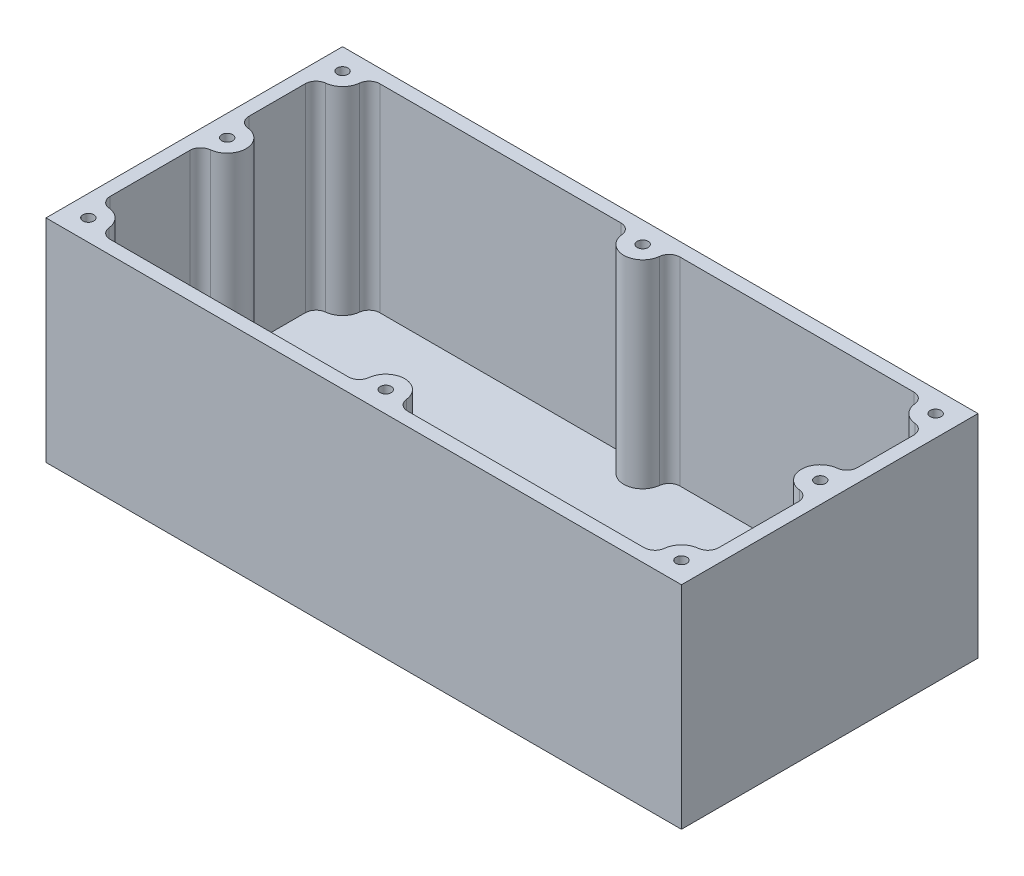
ISO-10303-21;
HEADER;
FILE_DESCRIPTION(('STEP AP214'),'2;1');
FILE_NAME('part.step','',(''),(''),'','','');
FILE_SCHEMA(('AUTOMOTIVE_DESIGN { 1 0 10303 214 1 1 1 1 }'));
ENDSEC;
DATA;
#1=APPLICATION_CONTEXT('core data for automotive mechanical design processes');
#2=APPLICATION_PROTOCOL_DEFINITION('international standard','automotive_design',2000,#1);
#3=PRODUCT_CONTEXT('',#1,'mechanical');
#4=PRODUCT('Part','Part','',(#3));
#5=PRODUCT_RELATED_PRODUCT_CATEGORY('part','',(#4));
#6=PRODUCT_DEFINITION_FORMATION('','',#4);
#7=PRODUCT_DEFINITION_CONTEXT('part definition',#1,'design');
#8=PRODUCT_DEFINITION('design','',#6,#7);
#9=PRODUCT_DEFINITION_SHAPE('','',#8);
#10=(LENGTH_UNIT() NAMED_UNIT(*) SI_UNIT(.MILLI.,.METRE.));
#11=(NAMED_UNIT(*) PLANE_ANGLE_UNIT() SI_UNIT($,.RADIAN.));
#12=(NAMED_UNIT(*) SI_UNIT($,.STERADIAN.) SOLID_ANGLE_UNIT());
#13=UNCERTAINTY_MEASURE_WITH_UNIT(LENGTH_MEASURE(1.E-05),#10,'distance_accuracy_value','');
#14=(GEOMETRIC_REPRESENTATION_CONTEXT(3) GLOBAL_UNCERTAINTY_ASSIGNED_CONTEXT((#13)) GLOBAL_UNIT_ASSIGNED_CONTEXT((#10,
#11,#12)) REPRESENTATION_CONTEXT('',''));
#15=CARTESIAN_POINT('',(0.,0.,0.));
#16=DIRECTION('',(0.,0.,1.));
#17=DIRECTION('',(1.,0.,0.));
#18=AXIS2_PLACEMENT_3D('',#15,#16,#17);
#19=CARTESIAN_POINT('',(0.,50.,0.));
#20=DIRECTION('',(0.,-1.,0.));
#21=DIRECTION('',(0.,0.,-1.));
#22=AXIS2_PLACEMENT_3D('',#19,#20,#21);
#23=PLANE('',#22);
#24=CARTESIAN_POINT('',(70.,50.,-30.));
#25=DIRECTION('',(0.,1.,0.));
#26=DIRECTION('',(0.,0.,1.));
#27=AXIS2_PLACEMENT_3D('',#24,#25,#26);
#28=CIRCLE('',#27,1.28904999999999);
#29=CARTESIAN_POINT('',(70.,50.,-28.71095));
#30=VERTEX_POINT('',#29);
#31=EDGE_CURVE('E655',#30,#30,#28,.T.);
#32=ORIENTED_EDGE('',*,*,#31,.F.);
#33=EDGE_LOOP('',(#32));
#34=FACE_BOUND('',#33,.T.);
#35=CARTESIAN_POINT('',(70.,50.,-2.76133775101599));
#36=DIRECTION('',(0.,1.,0.));
#37=DIRECTION('',(0.,0.,1.));
#38=AXIS2_PLACEMENT_3D('',#35,#36,#37);
#39=CIRCLE('',#38,1.28904999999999);
#40=CARTESIAN_POINT('',(70.,50.,-1.472287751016));
#41=VERTEX_POINT('',#40);
#42=EDGE_CURVE('E663',#41,#41,#39,.T.);
#43=ORIENTED_EDGE('',*,*,#42,.F.);
#44=EDGE_LOOP('',(#43));
#45=FACE_BOUND('',#44,.T.);
#46=CARTESIAN_POINT('',(70.,50.,30.));
#47=DIRECTION('',(0.,1.,0.));
#48=DIRECTION('',(0.,0.,1.));
#49=AXIS2_PLACEMENT_3D('',#46,#47,#48);
#50=CIRCLE('',#49,1.28904999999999);
#51=CARTESIAN_POINT('',(70.,50.,31.28905));
#52=VERTEX_POINT('',#51);
#53=EDGE_CURVE('E671',#52,#52,#50,.T.);
#54=ORIENTED_EDGE('',*,*,#53,.F.);
#55=EDGE_LOOP('',(#54));
#56=FACE_BOUND('',#55,.T.);
#57=CARTESIAN_POINT('',(0.846805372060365,50.,-30.));
#58=DIRECTION('',(0.,1.,0.));
#59=DIRECTION('',(0.,0.,1.));
#60=AXIS2_PLACEMENT_3D('',#57,#58,#59);
#61=CIRCLE('',#60,1.28904999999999);
#62=CARTESIAN_POINT('',(0.846805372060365,50.,-28.71095));
#63=VERTEX_POINT('',#62);
#64=EDGE_CURVE('E679',#63,#63,#61,.T.);
#65=ORIENTED_EDGE('',*,*,#64,.F.);
#66=EDGE_LOOP('',(#65));
#67=FACE_BOUND('',#66,.T.);
#68=CARTESIAN_POINT('',(-70.,50.,-30.));
#69=DIRECTION('',(0.,1.,0.));
#70=DIRECTION('',(0.,0.,1.));
#71=AXIS2_PLACEMENT_3D('',#68,#69,#70);
#72=CIRCLE('',#71,1.28904999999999);
#73=CARTESIAN_POINT('',(-70.,50.,-28.71095));
#74=VERTEX_POINT('',#73);
#75=EDGE_CURVE('E687',#74,#74,#72,.T.);
#76=ORIENTED_EDGE('',*,*,#75,.F.);
#77=EDGE_LOOP('',(#76));
#78=FACE_BOUND('',#77,.T.);
#79=CARTESIAN_POINT('',(-70.,50.,-2.76133775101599));
#80=DIRECTION('',(0.,1.,0.));
#81=DIRECTION('',(0.,0.,1.));
#82=AXIS2_PLACEMENT_3D('',#79,#80,#81);
#83=CIRCLE('',#82,1.28904999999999);
#84=CARTESIAN_POINT('',(-70.,50.,-1.472287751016));
#85=VERTEX_POINT('',#84);
#86=EDGE_CURVE('E695',#85,#85,#83,.T.);
#87=ORIENTED_EDGE('',*,*,#86,.F.);
#88=EDGE_LOOP('',(#87));
#89=FACE_BOUND('',#88,.T.);
#90=CARTESIAN_POINT('',(-70.,50.,30.));
#91=DIRECTION('',(0.,1.,0.));
#92=DIRECTION('',(0.,0.,1.));
#93=AXIS2_PLACEMENT_3D('',#90,#91,#92);
#94=CIRCLE('',#93,1.28904999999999);
#95=CARTESIAN_POINT('',(-70.,50.,31.28905));
#96=VERTEX_POINT('',#95);
#97=EDGE_CURVE('E703',#96,#96,#94,.T.);
#98=ORIENTED_EDGE('',*,*,#97,.F.);
#99=EDGE_LOOP('',(#98));
#100=FACE_BOUND('',#99,.T.);
#101=CARTESIAN_POINT('',(0.198089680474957,50.,30.));
#102=DIRECTION('',(0.,1.,0.));
#103=DIRECTION('',(0.,0.,1.));
#104=AXIS2_PLACEMENT_3D('',#101,#102,#103);
#105=CIRCLE('',#104,1.28904999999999);
#106=CARTESIAN_POINT('',(0.198089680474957,50.,31.28905));
#107=VERTEX_POINT('',#106);
#108=EDGE_CURVE('E710',#107,#107,#105,.T.);
#109=ORIENTED_EDGE('',*,*,#108,.F.);
#110=EDGE_LOOP('',(#109));
#111=FACE_BOUND('',#110,.T.);
#112=DIRECTION('',(0.,0.,-1.));
#113=VECTOR('',#112,1.);
#114=CARTESIAN_POINT('',(-75.,50.,35.));
#115=LINE('',#114,#113);
#116=CARTESIAN_POINT('',(-75.,50.,35.));
#117=VERTEX_POINT('',#116);
#118=CARTESIAN_POINT('',(-75.,50.,-35.));
#119=VERTEX_POINT('',#118);
#120=EDGE_CURVE('E293',#117,#119,#115,.T.);
#121=ORIENTED_EDGE('',*,*,#120,.F.);
#122=DIRECTION('',(1.,0.,0.));
#123=VECTOR('',#122,1.);
#124=CARTESIAN_POINT('',(-75.,50.,35.));
#125=LINE('',#124,#123);
#126=CARTESIAN_POINT('',(75.,50.,35.));
#127=VERTEX_POINT('',#126);
#128=EDGE_CURVE('E289',#117,#127,#125,.T.);
#129=ORIENTED_EDGE('',*,*,#128,.T.);
#130=DIRECTION('',(0.,0.,-1.));
#131=VECTOR('',#130,1.);
#132=CARTESIAN_POINT('',(75.,50.,35.));
#133=LINE('',#132,#131);
#134=CARTESIAN_POINT('',(75.,50.,-35.));
#135=VERTEX_POINT('',#134);
#136=EDGE_CURVE('E295',#127,#135,#133,.T.);
#137=ORIENTED_EDGE('',*,*,#136,.T.);
#138=DIRECTION('',(1.,0.,0.));
#139=VECTOR('',#138,1.);
#140=CARTESIAN_POINT('',(-75.,50.,-35.));
#141=LINE('',#140,#139);
#142=EDGE_CURVE('E280',#119,#135,#141,.T.);
#143=ORIENTED_EDGE('',*,*,#142,.F.);
#144=EDGE_LOOP('',(#121,#129,#137,#143));
#145=FACE_BOUND('',#144,.T.);
#146=DIRECTION('',(1.,0.,0.));
#147=VECTOR('',#146,1.);
#148=CARTESIAN_POINT('',(0.,50.,31.825));
#149=LINE('',#148,#147);
#150=CARTESIAN_POINT('',(-63.0325405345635,50.,31.825));
#151=VERTEX_POINT('',#150);
#152=CARTESIAN_POINT('',(-6.76936978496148,50.,31.825));
#153=VERTEX_POINT('',#152);
#154=EDGE_CURVE('E624',#151,#153,#149,.T.);
#155=ORIENTED_EDGE('',*,*,#154,.F.);
#156=CARTESIAN_POINT('',(-63.0325405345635,50.,29.285));
#157=DIRECTION('',(0.,-1.,0.));
#158=DIRECTION('',(0.,0.,-1.));
#159=AXIS2_PLACEMENT_3D('',#156,#157,#158);
#160=CIRCLE('',#159,2.54);
#161=CARTESIAN_POINT('',(-65.5592710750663,50.,29.5442928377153));
#162=VERTEX_POINT('',#161);
#163=EDGE_CURVE('E491',#151,#162,#160,.T.);
#164=ORIENTED_EDGE('',*,*,#163,.T.);
#165=CARTESIAN_POINT('',(-70.,50.,30.));
#166=DIRECTION('',(0.,-1.,0.));
#167=DIRECTION('',(0.,0.,-1.));
#168=AXIS2_PLACEMENT_3D('',#165,#166,#167);
#169=CIRCLE('',#168,4.46404999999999);
#170=CARTESIAN_POINT('',(-69.5442928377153,50.,25.5592710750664));
#171=VERTEX_POINT('',#170);
#172=EDGE_CURVE('E608',#162,#171,#169,.F.);
#173=ORIENTED_EDGE('',*,*,#172,.T.);
#174=CARTESIAN_POINT('',(-69.285,50.,23.0325405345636));
#175=DIRECTION('',(0.,-1.,0.));
#176=DIRECTION('',(0.,0.,-1.));
#177=AXIS2_PLACEMENT_3D('',#174,#175,#176);
#178=CIRCLE('',#177,2.54);
#179=CARTESIAN_POINT('',(-71.825,50.,23.0325405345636));
#180=VERTEX_POINT('',#179);
#181=EDGE_CURVE('E52',#171,#180,#178,.T.);
#182=ORIENTED_EDGE('',*,*,#181,.T.);
#183=DIRECTION('',(0.,0.,-1.));
#184=VECTOR('',#183,1.);
#185=CARTESIAN_POINT('',(-71.825,50.,0.));
#186=LINE('',#185,#184);
#187=CARTESIAN_POINT('',(-71.825,50.,4.20612171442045));
#188=VERTEX_POINT('',#187);
#189=EDGE_CURVE('E536',#180,#188,#186,.T.);
#190=ORIENTED_EDGE('',*,*,#189,.T.);
#191=CARTESIAN_POINT('',(-69.285,50.,4.20612171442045));
#192=DIRECTION('',(0.,-1.,0.));
#193=DIRECTION('',(0.,0.,-1.));
#194=AXIS2_PLACEMENT_3D('',#191,#192,#193);
#195=CIRCLE('',#194,2.54);
#196=CARTESIAN_POINT('',(-69.5442928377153,50.,1.67939117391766));
#197=VERTEX_POINT('',#196);
#198=EDGE_CURVE('E59',#188,#197,#195,.T.);
#199=ORIENTED_EDGE('',*,*,#198,.T.);
#200=CARTESIAN_POINT('',(-70.,50.,-2.76133775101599));
#201=DIRECTION('',(0.,-1.,0.));
#202=DIRECTION('',(0.,0.,-1.));
#203=AXIS2_PLACEMENT_3D('',#200,#201,#202);
#204=CIRCLE('',#203,4.46404999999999);
#205=CARTESIAN_POINT('',(-69.5442928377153,50.,-7.20206667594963));
#206=VERTEX_POINT('',#205);
#207=EDGE_CURVE('E535',#197,#206,#204,.F.);
#208=ORIENTED_EDGE('',*,*,#207,.T.);
#209=CARTESIAN_POINT('',(-69.285,50.,-9.72879721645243));
#210=DIRECTION('',(0.,-1.,0.));
#211=DIRECTION('',(0.,0.,-1.));
#212=AXIS2_PLACEMENT_3D('',#209,#210,#211);
#213=CIRCLE('',#212,2.54);
#214=CARTESIAN_POINT('',(-71.825,50.,-9.72879721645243));
#215=VERTEX_POINT('',#214);
#216=EDGE_CURVE('E527',#206,#215,#213,.T.);
#217=ORIENTED_EDGE('',*,*,#216,.T.);
#218=CARTESIAN_POINT('',(-71.825,50.,-23.0325405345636));
#219=VERTEX_POINT('',#218);
#220=EDGE_CURVE('E619',#215,#219,#186,.T.);
#221=ORIENTED_EDGE('',*,*,#220,.T.);
#222=CARTESIAN_POINT('',(-69.285,50.,-23.0325405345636));
#223=DIRECTION('',(0.,-1.,0.));
#224=DIRECTION('',(0.,0.,-1.));
#225=AXIS2_PLACEMENT_3D('',#222,#223,#224);
#226=CIRCLE('',#225,2.54);
#227=CARTESIAN_POINT('',(-69.5442928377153,50.,-25.5592710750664));
#228=VERTEX_POINT('',#227);
#229=EDGE_CURVE('E524',#219,#228,#226,.T.);
#230=ORIENTED_EDGE('',*,*,#229,.T.);
#231=CARTESIAN_POINT('',(-70.,50.,-30.));
#232=DIRECTION('',(0.,-1.,0.));
#233=DIRECTION('',(0.,0.,-1.));
#234=AXIS2_PLACEMENT_3D('',#231,#232,#233);
#235=CIRCLE('',#234,4.46404999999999);
#236=CARTESIAN_POINT('',(-65.5592710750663,50.,-29.5442928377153));
#237=VERTEX_POINT('',#236);
#238=EDGE_CURVE('E602',#228,#237,#235,.F.);
#239=ORIENTED_EDGE('',*,*,#238,.T.);
#240=CARTESIAN_POINT('',(-63.0325405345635,50.,-29.285));
#241=DIRECTION('',(0.,-1.,0.));
#242=DIRECTION('',(0.,0.,-1.));
#243=AXIS2_PLACEMENT_3D('',#240,#241,#242);
#244=CIRCLE('',#243,2.54);
#245=CARTESIAN_POINT('',(-63.0325405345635,50.,-31.825));
#246=VERTEX_POINT('',#245);
#247=EDGE_CURVE('E521',#237,#246,#244,.T.);
#248=ORIENTED_EDGE('',*,*,#247,.T.);
#249=DIRECTION('',(1.,0.,0.));
#250=VECTOR('',#249,1.);
#251=CARTESIAN_POINT('',(0.,50.,-31.825));
#252=LINE('',#251,#250);
#253=CARTESIAN_POINT('',(-6.12065409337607,50.,-31.825));
#254=VERTEX_POINT('',#253);
#255=EDGE_CURVE('E631',#246,#254,#252,.T.);
#256=ORIENTED_EDGE('',*,*,#255,.T.);
#257=CARTESIAN_POINT('',(-6.12065409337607,50.,-29.285));
#258=DIRECTION('',(0.,-1.,0.));
#259=DIRECTION('',(0.,0.,-1.));
#260=AXIS2_PLACEMENT_3D('',#257,#258,#259);
#261=CIRCLE('',#260,2.54);
#262=CARTESIAN_POINT('',(-3.59392355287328,50.,-29.5442928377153));
#263=VERTEX_POINT('',#262);
#264=EDGE_CURVE('E518',#254,#263,#261,.T.);
#265=ORIENTED_EDGE('',*,*,#264,.T.);
#266=CARTESIAN_POINT('',(0.846805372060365,50.,-30.));
#267=DIRECTION('',(0.,-1.,0.));
#268=DIRECTION('',(0.,0.,-1.));
#269=AXIS2_PLACEMENT_3D('',#266,#267,#268);
#270=CIRCLE('',#269,4.46404999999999);
#271=CARTESIAN_POINT('',(5.28753429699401,50.,-29.5442928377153));
#272=VERTEX_POINT('',#271);
#273=EDGE_CURVE('E597',#263,#272,#270,.F.);
#274=ORIENTED_EDGE('',*,*,#273,.T.);
#275=CARTESIAN_POINT('',(7.8142648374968,50.,-29.285));
#276=DIRECTION('',(0.,-1.,0.));
#277=DIRECTION('',(0.,0.,-1.));
#278=AXIS2_PLACEMENT_3D('',#275,#276,#277);
#279=CIRCLE('',#278,2.54);
#280=CARTESIAN_POINT('',(7.8142648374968,50.,-31.825));
#281=VERTEX_POINT('',#280);
#282=EDGE_CURVE('E515',#272,#281,#279,.T.);
#283=ORIENTED_EDGE('',*,*,#282,.T.);
#284=CARTESIAN_POINT('',(63.0325405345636,50.,-31.825));
#285=VERTEX_POINT('',#284);
#286=EDGE_CURVE('E630',#281,#285,#252,.T.);
#287=ORIENTED_EDGE('',*,*,#286,.T.);
#288=CARTESIAN_POINT('',(63.0325405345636,50.,-29.285));
#289=DIRECTION('',(0.,-1.,0.));
#290=DIRECTION('',(0.,0.,-1.));
#291=AXIS2_PLACEMENT_3D('',#288,#289,#290);
#292=CIRCLE('',#291,2.54);
#293=CARTESIAN_POINT('',(65.5592710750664,50.,-29.5442928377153));
#294=VERTEX_POINT('',#293);
#295=EDGE_CURVE('E512',#285,#294,#292,.T.);
#296=ORIENTED_EDGE('',*,*,#295,.T.);
#297=CARTESIAN_POINT('',(70.,50.,-30.));
#298=DIRECTION('',(0.,-1.,0.));
#299=DIRECTION('',(0.,0.,-1.));
#300=AXIS2_PLACEMENT_3D('',#297,#298,#299);
#301=CIRCLE('',#300,4.46404999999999);
#302=CARTESIAN_POINT('',(69.5442928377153,50.,-25.5592710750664));
#303=VERTEX_POINT('',#302);
#304=EDGE_CURVE('E587',#294,#303,#301,.F.);
#305=ORIENTED_EDGE('',*,*,#304,.T.);
#306=CARTESIAN_POINT('',(69.285,50.,-23.0325405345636));
#307=DIRECTION('',(0.,-1.,0.));
#308=DIRECTION('',(0.,0.,-1.));
#309=AXIS2_PLACEMENT_3D('',#306,#307,#308);
#310=CIRCLE('',#309,2.54);
#311=CARTESIAN_POINT('',(71.825,50.,-23.0325405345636));
#312=VERTEX_POINT('',#311);
#313=EDGE_CURVE('E509',#303,#312,#310,.T.);
#314=ORIENTED_EDGE('',*,*,#313,.T.);
#315=DIRECTION('',(0.,0.,-1.));
#316=VECTOR('',#315,1.);
#317=CARTESIAN_POINT('',(71.825,50.,0.));
#318=LINE('',#317,#316);
#319=CARTESIAN_POINT('',(71.825,50.,-9.72879721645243));
#320=VERTEX_POINT('',#319);
#321=EDGE_CURVE('E626',#320,#312,#318,.T.);
#322=ORIENTED_EDGE('',*,*,#321,.F.);
#323=CARTESIAN_POINT('',(69.285,50.,-9.72879721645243));
#324=DIRECTION('',(0.,-1.,0.));
#325=DIRECTION('',(0.,0.,-1.));
#326=AXIS2_PLACEMENT_3D('',#323,#324,#325);
#327=CIRCLE('',#326,2.54);
#328=CARTESIAN_POINT('',(69.5442928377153,50.,-7.20206667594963));
#329=VERTEX_POINT('',#328);
#330=EDGE_CURVE('E506',#320,#329,#327,.T.);
#331=ORIENTED_EDGE('',*,*,#330,.T.);
#332=CARTESIAN_POINT('',(70.,50.,-2.76133775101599));
#333=DIRECTION('',(0.,-1.,0.));
#334=DIRECTION('',(0.,0.,-1.));
#335=AXIS2_PLACEMENT_3D('',#332,#333,#334);
#336=CIRCLE('',#335,4.46404999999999);
#337=CARTESIAN_POINT('',(69.5442928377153,50.,1.67939117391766));
#338=VERTEX_POINT('',#337);
#339=EDGE_CURVE('E586',#329,#338,#336,.F.);
#340=ORIENTED_EDGE('',*,*,#339,.T.);
#341=CARTESIAN_POINT('',(69.285,50.,4.20612171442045));
#342=DIRECTION('',(0.,-1.,0.));
#343=DIRECTION('',(0.,0.,-1.));
#344=AXIS2_PLACEMENT_3D('',#341,#342,#343);
#345=CIRCLE('',#344,2.54);
#346=CARTESIAN_POINT('',(71.825,50.,4.20612171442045));
#347=VERTEX_POINT('',#346);
#348=EDGE_CURVE('E503',#338,#347,#345,.T.);
#349=ORIENTED_EDGE('',*,*,#348,.T.);
#350=CARTESIAN_POINT('',(71.825,50.,23.0325405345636));
#351=VERTEX_POINT('',#350);
#352=EDGE_CURVE('E625',#351,#347,#318,.T.);
#353=ORIENTED_EDGE('',*,*,#352,.F.);
#354=CARTESIAN_POINT('',(69.285,50.,23.0325405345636));
#355=DIRECTION('',(0.,-1.,0.));
#356=DIRECTION('',(0.,0.,-1.));
#357=AXIS2_PLACEMENT_3D('',#354,#355,#356);
#358=CIRCLE('',#357,2.54);
#359=CARTESIAN_POINT('',(69.5442928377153,50.,25.5592710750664));
#360=VERTEX_POINT('',#359);
#361=EDGE_CURVE('E11',#351,#360,#358,.T.);
#362=ORIENTED_EDGE('',*,*,#361,.T.);
#363=CARTESIAN_POINT('',(70.,50.,30.));
#364=DIRECTION('',(0.,-1.,0.));
#365=DIRECTION('',(0.,0.,-1.));
#366=AXIS2_PLACEMENT_3D('',#363,#364,#365);
#367=CIRCLE('',#366,4.46404999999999);
#368=CARTESIAN_POINT('',(65.5592710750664,50.,29.5442928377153));
#369=VERTEX_POINT('',#368);
#370=EDGE_CURVE('E592',#360,#369,#367,.F.);
#371=ORIENTED_EDGE('',*,*,#370,.T.);
#372=CARTESIAN_POINT('',(63.0325405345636,50.,29.285));
#373=DIRECTION('',(0.,-1.,0.));
#374=DIRECTION('',(0.,0.,-1.));
#375=AXIS2_PLACEMENT_3D('',#372,#373,#374);
#376=CIRCLE('',#375,2.54);
#377=CARTESIAN_POINT('',(63.0325405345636,50.,31.825));
#378=VERTEX_POINT('',#377);
#379=EDGE_CURVE('E500',#369,#378,#376,.T.);
#380=ORIENTED_EDGE('',*,*,#379,.T.);
#381=CARTESIAN_POINT('',(7.1655491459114,50.,31.825));
#382=VERTEX_POINT('',#381);
#383=EDGE_CURVE('E620',#382,#378,#149,.T.);
#384=ORIENTED_EDGE('',*,*,#383,.F.);
#385=CARTESIAN_POINT('',(7.1655491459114,50.,29.285));
#386=DIRECTION('',(0.,-1.,0.));
#387=DIRECTION('',(0.,0.,-1.));
#388=AXIS2_PLACEMENT_3D('',#385,#386,#387);
#389=CIRCLE('',#388,2.54);
#390=CARTESIAN_POINT('',(4.6388186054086,50.,29.5442928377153));
#391=VERTEX_POINT('',#390);
#392=EDGE_CURVE('E497',#382,#391,#389,.T.);
#393=ORIENTED_EDGE('',*,*,#392,.T.);
#394=CARTESIAN_POINT('',(0.198089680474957,50.,30.));
#395=DIRECTION('',(0.,-1.,0.));
#396=DIRECTION('',(0.,0.,-1.));
#397=AXIS2_PLACEMENT_3D('',#394,#395,#396);
#398=CIRCLE('',#397,4.46404999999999);
#399=CARTESIAN_POINT('',(-4.24263924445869,50.,29.5442928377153));
#400=VERTEX_POINT('',#399);
#401=EDGE_CURVE('E613',#391,#400,#398,.F.);
#402=ORIENTED_EDGE('',*,*,#401,.T.);
#403=CARTESIAN_POINT('',(-6.76936978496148,50.,29.285));
#404=DIRECTION('',(0.,-1.,0.));
#405=DIRECTION('',(0.,0.,-1.));
#406=AXIS2_PLACEMENT_3D('',#403,#404,#405);
#407=CIRCLE('',#406,2.54);
#408=EDGE_CURVE('E494',#400,#153,#407,.T.);
#409=ORIENTED_EDGE('',*,*,#408,.T.);
#410=EDGE_LOOP('',(#155,#164,#173,#182,#190,#199,#208,#217,#221,#230,#239,#248,#256,#265,#274,
#283,#287,#296,#305,#314,#322,#331,#340,#349,#353,#362,#371,#380,#384,#393,#402,#409));
#411=FACE_BOUND('',#410,.T.);
#412=ADVANCED_FACE('F43',(#34,#45,#56,#67,#78,#89,#100,#111,#145,#411),#23,.F.);
#413=CARTESIAN_POINT('',(-75.,50.,35.));
#414=DIRECTION('',(-1.,0.,0.));
#415=DIRECTION('',(0.,0.,1.));
#416=AXIS2_PLACEMENT_3D('',#413,#414,#415);
#417=PLANE('',#416);
#418=DIRECTION('',(0.,0.,-1.));
#419=VECTOR('',#418,1.);
#420=CARTESIAN_POINT('',(-75.,0.,35.));
#421=LINE('',#420,#419);
#422=CARTESIAN_POINT('',(-75.,0.,35.));
#423=VERTEX_POINT('',#422);
#424=CARTESIAN_POINT('',(-75.,0.,-35.));
#425=VERTEX_POINT('',#424);
#426=EDGE_CURVE('E316',#423,#425,#421,.T.);
#427=ORIENTED_EDGE('',*,*,#426,.F.);
#428=DIRECTION('',(0.,-1.,0.));
#429=VECTOR('',#428,1.);
#430=CARTESIAN_POINT('',(-75.,50.,35.));
#431=LINE('',#430,#429);
#432=EDGE_CURVE('E300',#117,#423,#431,.T.);
#433=ORIENTED_EDGE('',*,*,#432,.F.);
#434=ORIENTED_EDGE('',*,*,#120,.T.);
#435=DIRECTION('',(0.,-1.,0.));
#436=VECTOR('',#435,1.);
#437=CARTESIAN_POINT('',(-75.,50.,-35.));
#438=LINE('',#437,#436);
#439=EDGE_CURVE('E277',#119,#425,#438,.T.);
#440=ORIENTED_EDGE('',*,*,#439,.T.);
#441=EDGE_LOOP('',(#427,#433,#434,#440));
#442=FACE_BOUND('',#441,.T.);
#443=ADVANCED_FACE('F299',(#442),#417,.T.);
#444=CARTESIAN_POINT('',(-75.,50.,35.));
#445=DIRECTION('',(0.,0.,-1.));
#446=DIRECTION('',(-1.,0.,0.));
#447=AXIS2_PLACEMENT_3D('',#444,#445,#446);
#448=PLANE('',#447);
#449=DIRECTION('',(1.,0.,0.));
#450=VECTOR('',#449,1.);
#451=CARTESIAN_POINT('',(-75.,0.,35.));
#452=LINE('',#451,#450);
#453=CARTESIAN_POINT('',(75.,0.,35.));
#454=VERTEX_POINT('',#453);
#455=EDGE_CURVE('E303',#423,#454,#452,.T.);
#456=ORIENTED_EDGE('',*,*,#455,.T.);
#457=DIRECTION('',(0.,-1.,0.));
#458=VECTOR('',#457,1.);
#459=CARTESIAN_POINT('',(75.,50.,35.));
#460=LINE('',#459,#458);
#461=EDGE_CURVE('E327',#127,#454,#460,.T.);
#462=ORIENTED_EDGE('',*,*,#461,.F.);
#463=ORIENTED_EDGE('',*,*,#128,.F.);
#464=ORIENTED_EDGE('',*,*,#432,.T.);
#465=EDGE_LOOP('',(#456,#462,#463,#464));
#466=FACE_BOUND('',#465,.T.);
#467=ADVANCED_FACE('F741',(#466),#448,.F.);
#468=CARTESIAN_POINT('',(75.,50.,35.));
#469=DIRECTION('',(-1.,0.,0.));
#470=DIRECTION('',(0.,0.,1.));
#471=AXIS2_PLACEMENT_3D('',#468,#469,#470);
#472=PLANE('',#471);
#473=DIRECTION('',(0.,0.,-1.));
#474=VECTOR('',#473,1.);
#475=CARTESIAN_POINT('',(75.,0.,35.));
#476=LINE('',#475,#474);
#477=CARTESIAN_POINT('',(75.,0.,-35.));
#478=VERTEX_POINT('',#477);
#479=EDGE_CURVE('E306',#454,#478,#476,.T.);
#480=ORIENTED_EDGE('',*,*,#479,.T.);
#481=DIRECTION('',(0.,-1.,0.));
#482=VECTOR('',#481,1.);
#483=CARTESIAN_POINT('',(75.,50.,-35.));
#484=LINE('',#483,#482);
#485=EDGE_CURVE('E288',#135,#478,#484,.T.);
#486=ORIENTED_EDGE('',*,*,#485,.F.);
#487=ORIENTED_EDGE('',*,*,#136,.F.);
#488=ORIENTED_EDGE('',*,*,#461,.T.);
#489=EDGE_LOOP('',(#480,#486,#487,#488));
#490=FACE_BOUND('',#489,.T.);
#491=ADVANCED_FACE('F748',(#490),#472,.F.);
#492=CARTESIAN_POINT('',(-75.,50.,-35.));
#493=DIRECTION('',(0.,0.,-1.));
#494=DIRECTION('',(-1.,0.,0.));
#495=AXIS2_PLACEMENT_3D('',#492,#493,#494);
#496=PLANE('',#495);
#497=DIRECTION('',(1.,0.,0.));
#498=VECTOR('',#497,1.);
#499=CARTESIAN_POINT('',(-75.,0.,-35.));
#500=LINE('',#499,#498);
#501=EDGE_CURVE('E282',#425,#478,#500,.T.);
#502=ORIENTED_EDGE('',*,*,#501,.F.);
#503=ORIENTED_EDGE('',*,*,#439,.F.);
#504=ORIENTED_EDGE('',*,*,#142,.T.);
#505=ORIENTED_EDGE('',*,*,#485,.T.);
#506=EDGE_LOOP('',(#502,#503,#504,#505));
#507=FACE_BOUND('',#506,.T.);
#508=ADVANCED_FACE('F279',(#507),#496,.T.);
#509=CARTESIAN_POINT('',(0.,0.,0.));
#510=DIRECTION('',(0.,-1.,0.));
#511=DIRECTION('',(0.,0.,-1.));
#512=AXIS2_PLACEMENT_3D('',#509,#510,#511);
#513=PLANE('',#512);
#514=CARTESIAN_POINT('',(70.,0.,-30.));
#515=DIRECTION('',(0.,1.,0.));
#516=DIRECTION('',(0.,0.,1.));
#517=AXIS2_PLACEMENT_3D('',#514,#515,#516);
#518=CIRCLE('',#517,1.28904999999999);
#519=CARTESIAN_POINT('',(70.,0.,-28.71095));
#520=VERTEX_POINT('',#519);
#521=EDGE_CURVE('E659',#520,#520,#518,.T.);
#522=ORIENTED_EDGE('',*,*,#521,.T.);
#523=EDGE_LOOP('',(#522));
#524=FACE_BOUND('',#523,.T.);
#525=CARTESIAN_POINT('',(70.,0.,-2.76133775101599));
#526=DIRECTION('',(0.,1.,0.));
#527=DIRECTION('',(0.,0.,1.));
#528=AXIS2_PLACEMENT_3D('',#525,#526,#527);
#529=CIRCLE('',#528,1.28904999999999);
#530=CARTESIAN_POINT('',(70.,0.,-1.472287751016));
#531=VERTEX_POINT('',#530);
#532=EDGE_CURVE('E667',#531,#531,#529,.T.);
#533=ORIENTED_EDGE('',*,*,#532,.T.);
#534=EDGE_LOOP('',(#533));
#535=FACE_BOUND('',#534,.T.);
#536=CARTESIAN_POINT('',(70.,0.,30.));
#537=DIRECTION('',(0.,1.,0.));
#538=DIRECTION('',(0.,0.,1.));
#539=AXIS2_PLACEMENT_3D('',#536,#537,#538);
#540=CIRCLE('',#539,1.28904999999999);
#541=CARTESIAN_POINT('',(70.,0.,31.28905));
#542=VERTEX_POINT('',#541);
#543=EDGE_CURVE('E675',#542,#542,#540,.T.);
#544=ORIENTED_EDGE('',*,*,#543,.T.);
#545=EDGE_LOOP('',(#544));
#546=FACE_BOUND('',#545,.T.);
#547=CARTESIAN_POINT('',(0.846805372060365,0.,-30.));
#548=DIRECTION('',(0.,1.,0.));
#549=DIRECTION('',(0.,0.,1.));
#550=AXIS2_PLACEMENT_3D('',#547,#548,#549);
#551=CIRCLE('',#550,1.28904999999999);
#552=CARTESIAN_POINT('',(0.846805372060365,0.,-28.71095));
#553=VERTEX_POINT('',#552);
#554=EDGE_CURVE('E683',#553,#553,#551,.T.);
#555=ORIENTED_EDGE('',*,*,#554,.T.);
#556=EDGE_LOOP('',(#555));
#557=FACE_BOUND('',#556,.T.);
#558=CARTESIAN_POINT('',(-70.,0.,-30.));
#559=DIRECTION('',(0.,1.,0.));
#560=DIRECTION('',(0.,0.,1.));
#561=AXIS2_PLACEMENT_3D('',#558,#559,#560);
#562=CIRCLE('',#561,1.28904999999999);
#563=CARTESIAN_POINT('',(-70.,0.,-28.71095));
#564=VERTEX_POINT('',#563);
#565=EDGE_CURVE('E691',#564,#564,#562,.T.);
#566=ORIENTED_EDGE('',*,*,#565,.T.);
#567=EDGE_LOOP('',(#566));
#568=FACE_BOUND('',#567,.T.);
#569=CARTESIAN_POINT('',(-70.,0.,-2.76133775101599));
#570=DIRECTION('',(0.,1.,0.));
#571=DIRECTION('',(0.,0.,1.));
#572=AXIS2_PLACEMENT_3D('',#569,#570,#571);
#573=CIRCLE('',#572,1.28904999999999);
#574=CARTESIAN_POINT('',(-70.,0.,-1.472287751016));
#575=VERTEX_POINT('',#574);
#576=EDGE_CURVE('E699',#575,#575,#573,.T.);
#577=ORIENTED_EDGE('',*,*,#576,.T.);
#578=EDGE_LOOP('',(#577));
#579=FACE_BOUND('',#578,.T.);
#580=CARTESIAN_POINT('',(-70.,0.,30.));
#581=DIRECTION('',(0.,1.,0.));
#582=DIRECTION('',(0.,0.,1.));
#583=AXIS2_PLACEMENT_3D('',#580,#581,#582);
#584=CIRCLE('',#583,1.28904999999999);
#585=CARTESIAN_POINT('',(-70.,0.,31.28905));
#586=VERTEX_POINT('',#585);
#587=EDGE_CURVE('E707',#586,#586,#584,.T.);
#588=ORIENTED_EDGE('',*,*,#587,.T.);
#589=EDGE_LOOP('',(#588));
#590=FACE_BOUND('',#589,.T.);
#591=CARTESIAN_POINT('',(0.198089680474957,0.,30.));
#592=DIRECTION('',(0.,1.,0.));
#593=DIRECTION('',(0.,0.,1.));
#594=AXIS2_PLACEMENT_3D('',#591,#592,#593);
#595=CIRCLE('',#594,1.28904999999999);
#596=CARTESIAN_POINT('',(0.198089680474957,0.,31.28905));
#597=VERTEX_POINT('',#596);
#598=EDGE_CURVE('E309',#597,#597,#595,.T.);
#599=ORIENTED_EDGE('',*,*,#598,.T.);
#600=EDGE_LOOP('',(#599));
#601=FACE_BOUND('',#600,.T.);
#602=ORIENTED_EDGE('',*,*,#426,.T.);
#603=ORIENTED_EDGE('',*,*,#501,.T.);
#604=ORIENTED_EDGE('',*,*,#479,.F.);
#605=ORIENTED_EDGE('',*,*,#455,.F.);
#606=EDGE_LOOP('',(#602,#603,#604,#605));
#607=FACE_BOUND('',#606,.T.);
#608=ADVANCED_FACE('F719',(#524,#535,#546,#557,#568,#579,#590,#601,#607),#513,.T.);
#609=CARTESIAN_POINT('',(0.198089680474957,50.,30.));
#610=DIRECTION('',(0.,1.,0.));
#611=DIRECTION('',(0.,0.,1.));
#612=AXIS2_PLACEMENT_3D('',#609,#610,#611);
#613=CYLINDRICAL_SURFACE('',#612,1.28904999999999);
#614=ORIENTED_EDGE('',*,*,#598,.F.);
#615=EDGE_LOOP('',(#614));
#616=FACE_BOUND('',#615,.T.);
#617=ORIENTED_EDGE('',*,*,#108,.T.);
#618=EDGE_LOOP('',(#617));
#619=FACE_BOUND('',#618,.T.);
#620=ADVANCED_FACE('F722',(#616,#619),#613,.F.);
#621=CARTESIAN_POINT('',(-70.,50.,30.));
#622=DIRECTION('',(0.,1.,0.));
#623=DIRECTION('',(0.,0.,1.));
#624=AXIS2_PLACEMENT_3D('',#621,#622,#623);
#625=CYLINDRICAL_SURFACE('',#624,1.28904999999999);
#626=ORIENTED_EDGE('',*,*,#587,.F.);
#627=EDGE_LOOP('',(#626));
#628=FACE_BOUND('',#627,.T.);
#629=ORIENTED_EDGE('',*,*,#97,.T.);
#630=EDGE_LOOP('',(#629));
#631=FACE_BOUND('',#630,.T.);
#632=ADVANCED_FACE('F724',(#628,#631),#625,.F.);
#633=CARTESIAN_POINT('',(-70.,50.,-2.76133775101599));
#634=DIRECTION('',(0.,1.,0.));
#635=DIRECTION('',(0.,0.,1.));
#636=AXIS2_PLACEMENT_3D('',#633,#634,#635);
#637=CYLINDRICAL_SURFACE('',#636,1.28904999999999);
#638=ORIENTED_EDGE('',*,*,#576,.F.);
#639=EDGE_LOOP('',(#638));
#640=FACE_BOUND('',#639,.T.);
#641=ORIENTED_EDGE('',*,*,#86,.T.);
#642=EDGE_LOOP('',(#641));
#643=FACE_BOUND('',#642,.T.);
#644=ADVANCED_FACE('F730',(#640,#643),#637,.F.);
#645=CARTESIAN_POINT('',(-70.,50.,-30.));
#646=DIRECTION('',(0.,1.,0.));
#647=DIRECTION('',(0.,0.,1.));
#648=AXIS2_PLACEMENT_3D('',#645,#646,#647);
#649=CYLINDRICAL_SURFACE('',#648,1.28904999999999);
#650=ORIENTED_EDGE('',*,*,#565,.F.);
#651=EDGE_LOOP('',(#650));
#652=FACE_BOUND('',#651,.T.);
#653=ORIENTED_EDGE('',*,*,#75,.T.);
#654=EDGE_LOOP('',(#653));
#655=FACE_BOUND('',#654,.T.);
#656=ADVANCED_FACE('F948',(#652,#655),#649,.F.);
#657=CARTESIAN_POINT('',(0.846805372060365,50.,-30.));
#658=DIRECTION('',(0.,1.,0.));
#659=DIRECTION('',(0.,0.,1.));
#660=AXIS2_PLACEMENT_3D('',#657,#658,#659);
#661=CYLINDRICAL_SURFACE('',#660,1.28904999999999);
#662=ORIENTED_EDGE('',*,*,#554,.F.);
#663=EDGE_LOOP('',(#662));
#664=FACE_BOUND('',#663,.T.);
#665=ORIENTED_EDGE('',*,*,#64,.T.);
#666=EDGE_LOOP('',(#665));
#667=FACE_BOUND('',#666,.T.);
#668=ADVANCED_FACE('F944',(#664,#667),#661,.F.);
#669=CARTESIAN_POINT('',(70.,50.,30.));
#670=DIRECTION('',(0.,1.,0.));
#671=DIRECTION('',(0.,0.,1.));
#672=AXIS2_PLACEMENT_3D('',#669,#670,#671);
#673=CYLINDRICAL_SURFACE('',#672,1.28904999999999);
#674=ORIENTED_EDGE('',*,*,#543,.F.);
#675=EDGE_LOOP('',(#674));
#676=FACE_BOUND('',#675,.T.);
#677=ORIENTED_EDGE('',*,*,#53,.T.);
#678=EDGE_LOOP('',(#677));
#679=FACE_BOUND('',#678,.T.);
#680=ADVANCED_FACE('F940',(#676,#679),#673,.F.);
#681=CARTESIAN_POINT('',(70.,50.,-2.76133775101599));
#682=DIRECTION('',(0.,1.,0.));
#683=DIRECTION('',(0.,0.,1.));
#684=AXIS2_PLACEMENT_3D('',#681,#682,#683);
#685=CYLINDRICAL_SURFACE('',#684,1.28904999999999);
#686=ORIENTED_EDGE('',*,*,#532,.F.);
#687=EDGE_LOOP('',(#686));
#688=FACE_BOUND('',#687,.T.);
#689=ORIENTED_EDGE('',*,*,#42,.T.);
#690=EDGE_LOOP('',(#689));
#691=FACE_BOUND('',#690,.T.);
#692=ADVANCED_FACE('F936',(#688,#691),#685,.F.);
#693=CARTESIAN_POINT('',(70.,50.,-30.));
#694=DIRECTION('',(0.,1.,0.));
#695=DIRECTION('',(0.,0.,1.));
#696=AXIS2_PLACEMENT_3D('',#693,#694,#695);
#697=CYLINDRICAL_SURFACE('',#696,1.28904999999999);
#698=ORIENTED_EDGE('',*,*,#521,.F.);
#699=EDGE_LOOP('',(#698));
#700=FACE_BOUND('',#699,.T.);
#701=ORIENTED_EDGE('',*,*,#31,.T.);
#702=EDGE_LOOP('',(#701));
#703=FACE_BOUND('',#702,.T.);
#704=ADVANCED_FACE('F933',(#700,#703),#697,.F.);
#705=CARTESIAN_POINT('',(71.825,50.,35.));
#706=DIRECTION('',(-1.,0.,0.));
#707=DIRECTION('',(0.,0.,1.));
#708=AXIS2_PLACEMENT_3D('',#705,#706,#707);
#709=PLANE('',#708);
#710=ORIENTED_EDGE('',*,*,#352,.T.);
#711=DIRECTION('',(0.,-1.,0.));
#712=VECTOR('',#711,1.);
#713=CARTESIAN_POINT('',(71.825,3.175,4.20612171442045));
#714=LINE('',#713,#712);
#715=CARTESIAN_POINT('',(71.825,3.175,4.20612171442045));
#716=VERTEX_POINT('',#715);
#717=EDGE_CURVE('E419',#347,#716,#714,.T.);
#718=ORIENTED_EDGE('',*,*,#717,.T.);
#719=DIRECTION('',(0.,0.,-1.));
#720=VECTOR('',#719,1.);
#721=CARTESIAN_POINT('',(71.825,3.175,0.));
#722=LINE('',#721,#720);
#723=CARTESIAN_POINT('',(71.825,3.175,23.0325405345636));
#724=VERTEX_POINT('',#723);
#725=EDGE_CURVE('E578',#724,#716,#722,.T.);
#726=ORIENTED_EDGE('',*,*,#725,.F.);
#727=DIRECTION('',(0.,-1.,0.));
#728=VECTOR('',#727,1.);
#729=CARTESIAN_POINT('',(71.825,50.,23.0325405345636));
#730=LINE('',#729,#728);
#731=EDGE_CURVE('E416',#724,#351,#730,.F.);
#732=ORIENTED_EDGE('',*,*,#731,.T.);
#733=EDGE_LOOP('',(#710,#718,#726,#732));
#734=FACE_BOUND('',#733,.T.);
#735=ADVANCED_FACE('F853',(#734),#709,.T.);
#736=CARTESIAN_POINT('',(-75.,50.,-31.825));
#737=DIRECTION('',(0.,0.,-1.));
#738=DIRECTION('',(-1.,0.,0.));
#739=AXIS2_PLACEMENT_3D('',#736,#737,#738);
#740=PLANE('',#739);
#741=DIRECTION('',(1.,0.,0.));
#742=VECTOR('',#741,1.);
#743=CARTESIAN_POINT('',(0.,3.175,-31.825));
#744=LINE('',#743,#742);
#745=CARTESIAN_POINT('',(-63.0325405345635,3.175,-31.825));
#746=VERTEX_POINT('',#745);
#747=CARTESIAN_POINT('',(-6.12065409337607,3.175,-31.825));
#748=VERTEX_POINT('',#747);
#749=EDGE_CURVE('E565',#746,#748,#744,.T.);
#750=ORIENTED_EDGE('',*,*,#749,.T.);
#751=DIRECTION('',(0.,1.,0.));
#752=VECTOR('',#751,1.);
#753=CARTESIAN_POINT('',(-6.12065409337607,50.,-31.825));
#754=LINE('',#753,#752);
#755=EDGE_CURVE('E460',#748,#254,#754,.T.);
#756=ORIENTED_EDGE('',*,*,#755,.T.);
#757=ORIENTED_EDGE('',*,*,#255,.F.);
#758=DIRECTION('',(0.,1.,0.));
#759=VECTOR('',#758,1.);
#760=CARTESIAN_POINT('',(-63.0325405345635,50.,-31.825));
#761=LINE('',#760,#759);
#762=EDGE_CURVE('E457',#246,#746,#761,.F.);
#763=ORIENTED_EDGE('',*,*,#762,.T.);
#764=EDGE_LOOP('',(#750,#756,#757,#763));
#765=FACE_BOUND('',#764,.T.);
#766=ADVANCED_FACE('F887',(#765),#740,.F.);
#767=CARTESIAN_POINT('',(-71.825,50.,35.));
#768=DIRECTION('',(-1.,0.,0.));
#769=DIRECTION('',(0.,0.,1.));
#770=AXIS2_PLACEMENT_3D('',#767,#768,#769);
#771=PLANE('',#770);
#772=DIRECTION('',(0.,0.,-1.));
#773=VECTOR('',#772,1.);
#774=CARTESIAN_POINT('',(-71.825,3.175,0.));
#775=LINE('',#774,#773);
#776=CARTESIAN_POINT('',(-71.825,3.175,23.0325405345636));
#777=VERTEX_POINT('',#776);
#778=CARTESIAN_POINT('',(-71.825,3.175,4.20612171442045));
#779=VERTEX_POINT('',#778);
#780=EDGE_CURVE('E553',#777,#779,#775,.T.);
#781=ORIENTED_EDGE('',*,*,#780,.T.);
#782=DIRECTION('',(0.,1.,0.));
#783=VECTOR('',#782,1.);
#784=CARTESIAN_POINT('',(-71.825,50.,4.20612171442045));
#785=LINE('',#784,#783);
#786=EDGE_CURVE('E488',#779,#188,#785,.T.);
#787=ORIENTED_EDGE('',*,*,#786,.T.);
#788=ORIENTED_EDGE('',*,*,#189,.F.);
#789=DIRECTION('',(0.,1.,0.));
#790=VECTOR('',#789,1.);
#791=CARTESIAN_POINT('',(-71.825,50.,23.0325405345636));
#792=LINE('',#791,#790);
#793=EDGE_CURVE('E485',#180,#777,#792,.F.);
#794=ORIENTED_EDGE('',*,*,#793,.T.);
#795=EDGE_LOOP('',(#781,#787,#788,#794));
#796=FACE_BOUND('',#795,.T.);
#797=ADVANCED_FACE('F556',(#796),#771,.F.);
#798=CARTESIAN_POINT('',(-75.,50.,31.825));
#799=DIRECTION('',(0.,0.,-1.));
#800=DIRECTION('',(-1.,0.,0.));
#801=AXIS2_PLACEMENT_3D('',#798,#799,#800);
#802=PLANE('',#801);
#803=DIRECTION('',(1.,0.,0.));
#804=VECTOR('',#803,1.);
#805=CARTESIAN_POINT('',(0.,3.175,31.825));
#806=LINE('',#805,#804);
#807=CARTESIAN_POINT('',(-63.0325405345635,3.175,31.825));
#808=VERTEX_POINT('',#807);
#809=CARTESIAN_POINT('',(-6.76936978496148,3.175,31.825));
#810=VERTEX_POINT('',#809);
#811=EDGE_CURVE('E570',#808,#810,#806,.T.);
#812=ORIENTED_EDGE('',*,*,#811,.F.);
#813=DIRECTION('',(0.,-1.,0.));
#814=VECTOR('',#813,1.);
#815=CARTESIAN_POINT('',(-63.0325405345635,50.,31.825));
#816=LINE('',#815,#814);
#817=EDGE_CURVE('E392',#808,#151,#816,.F.);
#818=ORIENTED_EDGE('',*,*,#817,.T.);
#819=ORIENTED_EDGE('',*,*,#154,.T.);
#820=DIRECTION('',(0.,-1.,0.));
#821=VECTOR('',#820,1.);
#822=CARTESIAN_POINT('',(-6.76936978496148,3.175,31.825));
#823=LINE('',#822,#821);
#824=EDGE_CURVE('E388',#153,#810,#823,.T.);
#825=ORIENTED_EDGE('',*,*,#824,.T.);
#826=EDGE_LOOP('',(#812,#818,#819,#825));
#827=FACE_BOUND('',#826,.T.);
#828=ADVANCED_FACE('F825',(#827),#802,.T.);
#829=CARTESIAN_POINT('',(-71.825,3.175,-9.72879721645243));
#830=VERTEX_POINT('',#829);
#831=CARTESIAN_POINT('',(-71.825,3.175,-23.0325405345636));
#832=VERTEX_POINT('',#831);
#833=EDGE_CURVE('E560',#830,#832,#775,.T.);
#834=ORIENTED_EDGE('',*,*,#833,.T.);
#835=DIRECTION('',(0.,1.,0.));
#836=VECTOR('',#835,1.);
#837=CARTESIAN_POINT('',(-71.825,50.,-23.0325405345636));
#838=LINE('',#837,#836);
#839=EDGE_CURVE('E474',#832,#219,#838,.T.);
#840=ORIENTED_EDGE('',*,*,#839,.T.);
#841=ORIENTED_EDGE('',*,*,#220,.F.);
#842=DIRECTION('',(0.,1.,0.));
#843=VECTOR('',#842,1.);
#844=CARTESIAN_POINT('',(-71.825,50.,-9.72879721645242));
#845=LINE('',#844,#843);
#846=EDGE_CURVE('E471',#215,#830,#845,.F.);
#847=ORIENTED_EDGE('',*,*,#846,.T.);
#848=EDGE_LOOP('',(#834,#840,#841,#847));
#849=FACE_BOUND('',#848,.T.);
#850=ADVANCED_FACE('F872',(#849),#771,.F.);
#851=CARTESIAN_POINT('',(7.1655491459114,3.175,31.825));
#852=VERTEX_POINT('',#851);
#853=CARTESIAN_POINT('',(63.0325405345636,3.175,31.825));
#854=VERTEX_POINT('',#853);
#855=EDGE_CURVE('E574',#852,#854,#806,.T.);
#856=ORIENTED_EDGE('',*,*,#855,.F.);
#857=DIRECTION('',(0.,-1.,0.));
#858=VECTOR('',#857,1.);
#859=CARTESIAN_POINT('',(7.1655491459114,50.,31.825));
#860=LINE('',#859,#858);
#861=EDGE_CURVE('E406',#852,#382,#860,.F.);
#862=ORIENTED_EDGE('',*,*,#861,.T.);
#863=ORIENTED_EDGE('',*,*,#383,.T.);
#864=DIRECTION('',(0.,-1.,0.));
#865=VECTOR('',#864,1.);
#866=CARTESIAN_POINT('',(63.0325405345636,3.175,31.825));
#867=LINE('',#866,#865);
#868=EDGE_CURVE('E402',#378,#854,#867,.T.);
#869=ORIENTED_EDGE('',*,*,#868,.T.);
#870=EDGE_LOOP('',(#856,#862,#863,#869));
#871=FACE_BOUND('',#870,.T.);
#872=ADVANCED_FACE('F840',(#871),#802,.T.);
#873=CARTESIAN_POINT('',(71.825,3.175,-9.72879721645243));
#874=VERTEX_POINT('',#873);
#875=CARTESIAN_POINT('',(71.825,3.175,-23.0325405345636));
#876=VERTEX_POINT('',#875);
#877=EDGE_CURVE('E575',#874,#876,#722,.T.);
#878=ORIENTED_EDGE('',*,*,#877,.F.);
#879=DIRECTION('',(0.,-1.,0.));
#880=VECTOR('',#879,1.);
#881=CARTESIAN_POINT('',(71.825,50.,-9.72879721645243));
#882=LINE('',#881,#880);
#883=EDGE_CURVE('E434',#874,#320,#882,.F.);
#884=ORIENTED_EDGE('',*,*,#883,.T.);
#885=ORIENTED_EDGE('',*,*,#321,.T.);
#886=DIRECTION('',(0.,-1.,0.));
#887=VECTOR('',#886,1.);
#888=CARTESIAN_POINT('',(71.825,3.175,-23.0325405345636));
#889=LINE('',#888,#887);
#890=EDGE_CURVE('E430',#312,#876,#889,.T.);
#891=ORIENTED_EDGE('',*,*,#890,.T.);
#892=EDGE_LOOP('',(#878,#884,#885,#891));
#893=FACE_BOUND('',#892,.T.);
#894=ADVANCED_FACE('F915',(#893),#709,.T.);
#895=CARTESIAN_POINT('',(7.8142648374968,3.175,-31.825));
#896=VERTEX_POINT('',#895);
#897=CARTESIAN_POINT('',(63.0325405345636,3.175,-31.825));
#898=VERTEX_POINT('',#897);
#899=EDGE_CURVE('E559',#896,#898,#744,.T.);
#900=ORIENTED_EDGE('',*,*,#899,.T.);
#901=DIRECTION('',(0.,1.,0.));
#902=VECTOR('',#901,1.);
#903=CARTESIAN_POINT('',(63.0325405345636,50.,-31.825));
#904=LINE('',#903,#902);
#905=EDGE_CURVE('E446',#898,#285,#904,.T.);
#906=ORIENTED_EDGE('',*,*,#905,.T.);
#907=ORIENTED_EDGE('',*,*,#286,.F.);
#908=DIRECTION('',(0.,1.,0.));
#909=VECTOR('',#908,1.);
#910=CARTESIAN_POINT('',(7.81426483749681,50.,-31.825));
#911=LINE('',#910,#909);
#912=EDGE_CURVE('E443',#281,#896,#911,.F.);
#913=ORIENTED_EDGE('',*,*,#912,.T.);
#914=EDGE_LOOP('',(#900,#906,#907,#913));
#915=FACE_BOUND('',#914,.T.);
#916=ADVANCED_FACE('F900',(#915),#740,.F.);
#917=CARTESIAN_POINT('',(0.,3.175,0.));
#918=DIRECTION('',(0.,-1.,0.));
#919=DIRECTION('',(0.,0.,-1.));
#920=AXIS2_PLACEMENT_3D('',#917,#918,#919);
#921=PLANE('',#920);
#922=CARTESIAN_POINT('',(-70.,3.175,30.));
#923=DIRECTION('',(0.,-1.,0.));
#924=DIRECTION('',(0.,0.,-1.));
#925=AXIS2_PLACEMENT_3D('',#922,#923,#924);
#926=CIRCLE('',#925,4.46404999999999);
#927=CARTESIAN_POINT('',(-65.5592710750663,3.175,29.5442928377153));
#928=VERTEX_POINT('',#927);
#929=CARTESIAN_POINT('',(-69.5442928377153,3.175,25.5592710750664));
#930=VERTEX_POINT('',#929);
#931=EDGE_CURVE('E609',#928,#930,#926,.F.);
#932=ORIENTED_EDGE('',*,*,#931,.F.);
#933=CARTESIAN_POINT('',(-63.0325405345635,3.175,29.285));
#934=DIRECTION('',(0.,-1.,0.));
#935=DIRECTION('',(0.,0.,-1.));
#936=AXIS2_PLACEMENT_3D('',#933,#934,#935);
#937=CIRCLE('',#936,2.54);
#938=EDGE_CURVE('E385',#928,#808,#937,.F.);
#939=ORIENTED_EDGE('',*,*,#938,.T.);
#940=ORIENTED_EDGE('',*,*,#811,.T.);
#941=CARTESIAN_POINT('',(-6.76936978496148,3.175,29.285));
#942=DIRECTION('',(0.,-1.,0.));
#943=DIRECTION('',(0.,0.,-1.));
#944=AXIS2_PLACEMENT_3D('',#941,#942,#943);
#945=CIRCLE('',#944,2.54);
#946=CARTESIAN_POINT('',(-4.24263924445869,3.175,29.5442928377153));
#947=VERTEX_POINT('',#946);
#948=EDGE_CURVE('E382',#810,#947,#945,.F.);
#949=ORIENTED_EDGE('',*,*,#948,.T.);
#950=CARTESIAN_POINT('',(0.198089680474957,3.175,30.));
#951=DIRECTION('',(0.,-1.,0.));
#952=DIRECTION('',(0.,0.,-1.));
#953=AXIS2_PLACEMENT_3D('',#950,#951,#952);
#954=CIRCLE('',#953,4.46404999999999);
#955=CARTESIAN_POINT('',(4.6388186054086,3.175,29.5442928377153));
#956=VERTEX_POINT('',#955);
#957=EDGE_CURVE('E568',#956,#947,#954,.F.);
#958=ORIENTED_EDGE('',*,*,#957,.F.);
#959=CARTESIAN_POINT('',(7.1655491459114,3.175,29.285));
#960=DIRECTION('',(0.,-1.,0.));
#961=DIRECTION('',(0.,0.,-1.));
#962=AXIS2_PLACEMENT_3D('',#959,#960,#961);
#963=CIRCLE('',#962,2.54);
#964=EDGE_CURVE('E379',#956,#852,#963,.F.);
#965=ORIENTED_EDGE('',*,*,#964,.T.);
#966=ORIENTED_EDGE('',*,*,#855,.T.);
#967=CARTESIAN_POINT('',(63.0325405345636,3.175,29.285));
#968=DIRECTION('',(0.,-1.,0.));
#969=DIRECTION('',(0.,0.,-1.));
#970=AXIS2_PLACEMENT_3D('',#967,#968,#969);
#971=CIRCLE('',#970,2.54);
#972=CARTESIAN_POINT('',(65.5592710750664,3.175,29.5442928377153));
#973=VERTEX_POINT('',#972);
#974=EDGE_CURVE('E376',#854,#973,#971,.F.);
#975=ORIENTED_EDGE('',*,*,#974,.T.);
#976=CARTESIAN_POINT('',(70.,3.175,30.));
#977=DIRECTION('',(0.,-1.,0.));
#978=DIRECTION('',(0.,0.,-1.));
#979=AXIS2_PLACEMENT_3D('',#976,#977,#978);
#980=CIRCLE('',#979,4.46404999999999);
#981=CARTESIAN_POINT('',(69.5442928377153,3.175,25.5592710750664));
#982=VERTEX_POINT('',#981);
#983=EDGE_CURVE('E593',#982,#973,#980,.F.);
#984=ORIENTED_EDGE('',*,*,#983,.F.);
#985=CARTESIAN_POINT('',(69.285,3.175,23.0325405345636));
#986=DIRECTION('',(0.,-1.,0.));
#987=DIRECTION('',(0.,0.,-1.));
#988=AXIS2_PLACEMENT_3D('',#985,#986,#987);
#989=CIRCLE('',#988,2.54);
#990=EDGE_CURVE('E340',#982,#724,#989,.F.);
#991=ORIENTED_EDGE('',*,*,#990,.T.);
#992=ORIENTED_EDGE('',*,*,#725,.T.);
#993=CARTESIAN_POINT('',(69.285,3.175,4.20612171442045));
#994=DIRECTION('',(0.,-1.,0.));
#995=DIRECTION('',(0.,0.,-1.));
#996=AXIS2_PLACEMENT_3D('',#993,#994,#995);
#997=CIRCLE('',#996,2.54);
#998=CARTESIAN_POINT('',(69.5442928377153,3.175,1.67939117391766));
#999=VERTEX_POINT('',#998);
#1000=EDGE_CURVE('E373',#716,#999,#997,.F.);
#1001=ORIENTED_EDGE('',*,*,#1000,.T.);
#1002=CARTESIAN_POINT('',(70.,3.175,-2.76133775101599));
#1003=DIRECTION('',(0.,-1.,0.));
#1004=DIRECTION('',(0.,0.,-1.));
#1005=AXIS2_PLACEMENT_3D('',#1002,#1003,#1004);
#1006=CIRCLE('',#1005,4.46404999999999);
#1007=CARTESIAN_POINT('',(69.5442928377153,3.175,-7.20206667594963));
#1008=VERTEX_POINT('',#1007);
#1009=EDGE_CURVE('E588',#1008,#999,#1006,.F.);
#1010=ORIENTED_EDGE('',*,*,#1009,.F.);
#1011=CARTESIAN_POINT('',(69.285,3.175,-9.72879721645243));
#1012=DIRECTION('',(0.,-1.,0.));
#1013=DIRECTION('',(0.,0.,-1.));
#1014=AXIS2_PLACEMENT_3D('',#1011,#1012,#1013);
#1015=CIRCLE('',#1014,2.54);
#1016=EDGE_CURVE('E370',#1008,#874,#1015,.F.);
#1017=ORIENTED_EDGE('',*,*,#1016,.T.);
#1018=ORIENTED_EDGE('',*,*,#877,.T.);
#1019=CARTESIAN_POINT('',(69.285,3.175,-23.0325405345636));
#1020=DIRECTION('',(0.,-1.,0.));
#1021=DIRECTION('',(0.,0.,-1.));
#1022=AXIS2_PLACEMENT_3D('',#1019,#1020,#1021);
#1023=CIRCLE('',#1022,2.54);
#1024=CARTESIAN_POINT('',(69.5442928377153,3.175,-25.5592710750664));
#1025=VERTEX_POINT('',#1024);
#1026=EDGE_CURVE('E367',#876,#1025,#1023,.F.);
#1027=ORIENTED_EDGE('',*,*,#1026,.T.);
#1028=CARTESIAN_POINT('',(70.,3.175,-30.));
#1029=DIRECTION('',(0.,-1.,0.));
#1030=DIRECTION('',(0.,0.,-1.));
#1031=AXIS2_PLACEMENT_3D('',#1028,#1029,#1030);
#1032=CIRCLE('',#1031,4.46404999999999);
#1033=CARTESIAN_POINT('',(65.5592710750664,3.175,-29.5442928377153));
#1034=VERTEX_POINT('',#1033);
#1035=EDGE_CURVE('E582',#1034,#1025,#1032,.F.);
#1036=ORIENTED_EDGE('',*,*,#1035,.F.);
#1037=CARTESIAN_POINT('',(63.0325405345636,3.175,-29.285));
#1038=DIRECTION('',(0.,-1.,0.));
#1039=DIRECTION('',(0.,0.,-1.));
#1040=AXIS2_PLACEMENT_3D('',#1037,#1038,#1039);
#1041=CIRCLE('',#1040,2.54);
#1042=EDGE_CURVE('E364',#1034,#898,#1041,.F.);
#1043=ORIENTED_EDGE('',*,*,#1042,.T.);
#1044=ORIENTED_EDGE('',*,*,#899,.F.);
#1045=CARTESIAN_POINT('',(7.8142648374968,3.175,-29.285));
#1046=DIRECTION('',(0.,-1.,0.));
#1047=DIRECTION('',(0.,0.,-1.));
#1048=AXIS2_PLACEMENT_3D('',#1045,#1046,#1047);
#1049=CIRCLE('',#1048,2.54);
#1050=CARTESIAN_POINT('',(5.28753429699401,3.175,-29.5442928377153));
#1051=VERTEX_POINT('',#1050);
#1052=EDGE_CURVE('E361',#896,#1051,#1049,.F.);
#1053=ORIENTED_EDGE('',*,*,#1052,.T.);
#1054=CARTESIAN_POINT('',(0.846805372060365,3.175,-30.));
#1055=DIRECTION('',(0.,-1.,0.));
#1056=DIRECTION('',(0.,0.,-1.));
#1057=AXIS2_PLACEMENT_3D('',#1054,#1055,#1056);
#1058=CIRCLE('',#1057,4.46404999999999);
#1059=CARTESIAN_POINT('',(-3.59392355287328,3.175,-29.5442928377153));
#1060=VERTEX_POINT('',#1059);
#1061=EDGE_CURVE('E598',#1060,#1051,#1058,.F.);
#1062=ORIENTED_EDGE('',*,*,#1061,.F.);
#1063=CARTESIAN_POINT('',(-6.12065409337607,3.175,-29.285));
#1064=DIRECTION('',(0.,-1.,0.));
#1065=DIRECTION('',(0.,0.,-1.));
#1066=AXIS2_PLACEMENT_3D('',#1063,#1064,#1065);
#1067=CIRCLE('',#1066,2.54);
#1068=EDGE_CURVE('E358',#1060,#748,#1067,.F.);
#1069=ORIENTED_EDGE('',*,*,#1068,.T.);
#1070=ORIENTED_EDGE('',*,*,#749,.F.);
#1071=CARTESIAN_POINT('',(-63.0325405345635,3.175,-29.285));
#1072=DIRECTION('',(0.,-1.,0.));
#1073=DIRECTION('',(0.,0.,-1.));
#1074=AXIS2_PLACEMENT_3D('',#1071,#1072,#1073);
#1075=CIRCLE('',#1074,2.54);
#1076=CARTESIAN_POINT('',(-65.5592710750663,3.175,-29.5442928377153));
#1077=VERTEX_POINT('',#1076);
#1078=EDGE_CURVE('E355',#746,#1077,#1075,.F.);
#1079=ORIENTED_EDGE('',*,*,#1078,.T.);
#1080=CARTESIAN_POINT('',(-70.,3.175,-30.));
#1081=DIRECTION('',(0.,-1.,0.));
#1082=DIRECTION('',(0.,0.,-1.));
#1083=AXIS2_PLACEMENT_3D('',#1080,#1081,#1082);
#1084=CIRCLE('',#1083,4.46404999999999);
#1085=CARTESIAN_POINT('',(-69.5442928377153,3.175,-25.5592710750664));
#1086=VERTEX_POINT('',#1085);
#1087=EDGE_CURVE('E544',#1086,#1077,#1084,.F.);
#1088=ORIENTED_EDGE('',*,*,#1087,.F.);
#1089=CARTESIAN_POINT('',(-69.285,3.175,-23.0325405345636));
#1090=DIRECTION('',(0.,-1.,0.));
#1091=DIRECTION('',(0.,0.,-1.));
#1092=AXIS2_PLACEMENT_3D('',#1089,#1090,#1091);
#1093=CIRCLE('',#1092,2.54);
#1094=EDGE_CURVE('E352',#1086,#832,#1093,.F.);
#1095=ORIENTED_EDGE('',*,*,#1094,.T.);
#1096=ORIENTED_EDGE('',*,*,#833,.F.);
#1097=CARTESIAN_POINT('',(-69.285,3.175,-9.72879721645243));
#1098=DIRECTION('',(0.,-1.,0.));
#1099=DIRECTION('',(0.,0.,-1.));
#1100=AXIS2_PLACEMENT_3D('',#1097,#1098,#1099);
#1101=CIRCLE('',#1100,2.54);
#1102=CARTESIAN_POINT('',(-69.5442928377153,3.175,-7.20206667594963));
#1103=VERTEX_POINT('',#1102);
#1104=EDGE_CURVE('E349',#830,#1103,#1101,.F.);
#1105=ORIENTED_EDGE('',*,*,#1104,.T.);
#1106=CARTESIAN_POINT('',(-70.,3.175,-2.76133775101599));
#1107=DIRECTION('',(0.,-1.,0.));
#1108=DIRECTION('',(0.,0.,-1.));
#1109=AXIS2_PLACEMENT_3D('',#1106,#1107,#1108);
#1110=CIRCLE('',#1109,4.46404999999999);
#1111=CARTESIAN_POINT('',(-69.5442928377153,3.175,1.67939117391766));
#1112=VERTEX_POINT('',#1111);
#1113=EDGE_CURVE('E543',#1112,#1103,#1110,.F.);
#1114=ORIENTED_EDGE('',*,*,#1113,.F.);
#1115=CARTESIAN_POINT('',(-69.285,3.175,4.20612171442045));
#1116=DIRECTION('',(0.,-1.,0.));
#1117=DIRECTION('',(0.,0.,-1.));
#1118=AXIS2_PLACEMENT_3D('',#1115,#1116,#1117);
#1119=CIRCLE('',#1118,2.54);
#1120=EDGE_CURVE('E346',#1112,#779,#1119,.F.);
#1121=ORIENTED_EDGE('',*,*,#1120,.T.);
#1122=ORIENTED_EDGE('',*,*,#780,.F.);
#1123=CARTESIAN_POINT('',(-69.285,3.175,23.0325405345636));
#1124=DIRECTION('',(0.,-1.,0.));
#1125=DIRECTION('',(0.,0.,-1.));
#1126=AXIS2_PLACEMENT_3D('',#1123,#1124,#1125);
#1127=CIRCLE('',#1126,2.54);
#1128=EDGE_CURVE('E343',#777,#930,#1127,.F.);
#1129=ORIENTED_EDGE('',*,*,#1128,.T.);
#1130=EDGE_LOOP('',(#932,#939,#940,#949,#958,#965,#966,#975,#984,#991,#992,#1001,#1010,#1017,
#1018,#1027,#1036,#1043,#1044,#1053,#1062,#1069,#1070,#1079,#1088,#1095,#1096,#1105,#1114,#1121,
#1122,#1129));
#1131=FACE_BOUND('',#1130,.T.);
#1132=ADVANCED_FACE('F552',(#1131),#921,.F.);
#1133=CARTESIAN_POINT('',(0.198089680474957,50.,30.));
#1134=DIRECTION('',(0.,1.,0.));
#1135=DIRECTION('',(0.,0.,1.));
#1136=AXIS2_PLACEMENT_3D('',#1133,#1134,#1135);
#1137=CYLINDRICAL_SURFACE('',#1136,4.46404999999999);
#1138=ORIENTED_EDGE('',*,*,#957,.T.);
#1139=DIRECTION('',(0.,1.,0.));
#1140=VECTOR('',#1139,1.);
#1141=CARTESIAN_POINT('',(-4.24263924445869,50.,29.5442928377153));
#1142=LINE('',#1141,#1140);
#1143=EDGE_CURVE('E399',#947,#400,#1142,.T.);
#1144=ORIENTED_EDGE('',*,*,#1143,.T.);
#1145=ORIENTED_EDGE('',*,*,#401,.F.);
#1146=DIRECTION('',(0.,1.,0.));
#1147=VECTOR('',#1146,1.);
#1148=CARTESIAN_POINT('',(4.6388186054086,50.,29.5442928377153));
#1149=LINE('',#1148,#1147);
#1150=EDGE_CURVE('E395',#391,#956,#1149,.F.);
#1151=ORIENTED_EDGE('',*,*,#1150,.T.);
#1152=EDGE_LOOP('',(#1138,#1144,#1145,#1151));
#1153=FACE_BOUND('',#1152,.T.);
#1154=ADVANCED_FACE('F832',(#1153),#1137,.T.);
#1155=CARTESIAN_POINT('',(-70.,50.,30.));
#1156=DIRECTION('',(0.,1.,0.));
#1157=DIRECTION('',(0.,0.,1.));
#1158=AXIS2_PLACEMENT_3D('',#1155,#1156,#1157);
#1159=CYLINDRICAL_SURFACE('',#1158,4.46404999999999);
#1160=ORIENTED_EDGE('',*,*,#172,.F.);
#1161=DIRECTION('',(0.,1.,0.));
#1162=VECTOR('',#1161,1.);
#1163=CARTESIAN_POINT('',(-65.5592710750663,50.,29.5442928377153));
#1164=LINE('',#1163,#1162);
#1165=EDGE_CURVE('E336',#162,#928,#1164,.F.);
#1166=ORIENTED_EDGE('',*,*,#1165,.T.);
#1167=ORIENTED_EDGE('',*,*,#931,.T.);
#1168=DIRECTION('',(0.,1.,0.));
#1169=VECTOR('',#1168,1.);
#1170=CARTESIAN_POINT('',(-69.5442928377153,50.,25.5592710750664));
#1171=LINE('',#1170,#1169);
#1172=EDGE_CURVE('E326',#930,#171,#1171,.T.);
#1173=ORIENTED_EDGE('',*,*,#1172,.T.);
#1174=EDGE_LOOP('',(#1160,#1166,#1167,#1173));
#1175=FACE_BOUND('',#1174,.T.);
#1176=ADVANCED_FACE('F819',(#1175),#1159,.T.);
#1177=CARTESIAN_POINT('',(-70.,50.,-2.76133775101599));
#1178=DIRECTION('',(0.,1.,0.));
#1179=DIRECTION('',(0.,0.,1.));
#1180=AXIS2_PLACEMENT_3D('',#1177,#1178,#1179);
#1181=CYLINDRICAL_SURFACE('',#1180,4.46404999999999);
#1182=ORIENTED_EDGE('',*,*,#1113,.T.);
#1183=DIRECTION('',(0.,1.,0.));
#1184=VECTOR('',#1183,1.);
#1185=CARTESIAN_POINT('',(-69.5442928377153,50.,-7.20206667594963));
#1186=LINE('',#1185,#1184);
#1187=EDGE_CURVE('E481',#1103,#206,#1186,.T.);
#1188=ORIENTED_EDGE('',*,*,#1187,.T.);
#1189=ORIENTED_EDGE('',*,*,#207,.F.);
#1190=DIRECTION('',(0.,1.,0.));
#1191=VECTOR('',#1190,1.);
#1192=CARTESIAN_POINT('',(-69.5442928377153,50.,1.67939117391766));
#1193=LINE('',#1192,#1191);
#1194=EDGE_CURVE('E478',#197,#1112,#1193,.F.);
#1195=ORIENTED_EDGE('',*,*,#1194,.T.);
#1196=EDGE_LOOP('',(#1182,#1188,#1189,#1195));
#1197=FACE_BOUND('',#1196,.T.);
#1198=ADVANCED_FACE('F539',(#1197),#1181,.T.);
#1199=CARTESIAN_POINT('',(-70.,50.,-30.));
#1200=DIRECTION('',(0.,1.,0.));
#1201=DIRECTION('',(0.,0.,1.));
#1202=AXIS2_PLACEMENT_3D('',#1199,#1200,#1201);
#1203=CYLINDRICAL_SURFACE('',#1202,4.46404999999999);
#1204=ORIENTED_EDGE('',*,*,#1087,.T.);
#1205=DIRECTION('',(0.,1.,0.));
#1206=VECTOR('',#1205,1.);
#1207=CARTESIAN_POINT('',(-65.5592710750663,50.,-29.5442928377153));
#1208=LINE('',#1207,#1206);
#1209=EDGE_CURVE('E467',#1077,#237,#1208,.T.);
#1210=ORIENTED_EDGE('',*,*,#1209,.T.);
#1211=ORIENTED_EDGE('',*,*,#238,.F.);
#1212=DIRECTION('',(0.,1.,0.));
#1213=VECTOR('',#1212,1.);
#1214=CARTESIAN_POINT('',(-69.5442928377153,50.,-25.5592710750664));
#1215=LINE('',#1214,#1213);
#1216=EDGE_CURVE('E464',#228,#1086,#1215,.F.);
#1217=ORIENTED_EDGE('',*,*,#1216,.T.);
#1218=EDGE_LOOP('',(#1204,#1210,#1211,#1217));
#1219=FACE_BOUND('',#1218,.T.);
#1220=ADVANCED_FACE('F880',(#1219),#1203,.T.);
#1221=CARTESIAN_POINT('',(0.846805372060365,50.,-30.));
#1222=DIRECTION('',(0.,1.,0.));
#1223=DIRECTION('',(0.,0.,1.));
#1224=AXIS2_PLACEMENT_3D('',#1221,#1222,#1223);
#1225=CYLINDRICAL_SURFACE('',#1224,4.46404999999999);
#1226=ORIENTED_EDGE('',*,*,#1061,.T.);
#1227=DIRECTION('',(0.,1.,0.));
#1228=VECTOR('',#1227,1.);
#1229=CARTESIAN_POINT('',(5.28753429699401,50.,-29.5442928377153));
#1230=LINE('',#1229,#1228);
#1231=EDGE_CURVE('E453',#1051,#272,#1230,.T.);
#1232=ORIENTED_EDGE('',*,*,#1231,.T.);
#1233=ORIENTED_EDGE('',*,*,#273,.F.);
#1234=DIRECTION('',(0.,1.,0.));
#1235=VECTOR('',#1234,1.);
#1236=CARTESIAN_POINT('',(-3.59392355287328,50.,-29.5442928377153));
#1237=LINE('',#1236,#1235);
#1238=EDGE_CURVE('E450',#263,#1060,#1237,.F.);
#1239=ORIENTED_EDGE('',*,*,#1238,.T.);
#1240=EDGE_LOOP('',(#1226,#1232,#1233,#1239));
#1241=FACE_BOUND('',#1240,.T.);
#1242=ADVANCED_FACE('F893',(#1241),#1225,.T.);
#1243=CARTESIAN_POINT('',(70.,50.,30.));
#1244=DIRECTION('',(0.,1.,0.));
#1245=DIRECTION('',(0.,0.,1.));
#1246=AXIS2_PLACEMENT_3D('',#1243,#1244,#1245);
#1247=CYLINDRICAL_SURFACE('',#1246,4.46404999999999);
#1248=ORIENTED_EDGE('',*,*,#983,.T.);
#1249=DIRECTION('',(0.,1.,0.));
#1250=VECTOR('',#1249,1.);
#1251=CARTESIAN_POINT('',(65.5592710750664,50.,29.5442928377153));
#1252=LINE('',#1251,#1250);
#1253=EDGE_CURVE('E413',#973,#369,#1252,.T.);
#1254=ORIENTED_EDGE('',*,*,#1253,.T.);
#1255=ORIENTED_EDGE('',*,*,#370,.F.);
#1256=DIRECTION('',(0.,1.,0.));
#1257=VECTOR('',#1256,1.);
#1258=CARTESIAN_POINT('',(69.5442928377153,50.,25.5592710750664));
#1259=LINE('',#1258,#1257);
#1260=EDGE_CURVE('E409',#360,#982,#1259,.F.);
#1261=ORIENTED_EDGE('',*,*,#1260,.T.);
#1262=EDGE_LOOP('',(#1248,#1254,#1255,#1261));
#1263=FACE_BOUND('',#1262,.T.);
#1264=ADVANCED_FACE('F861',(#1263),#1247,.T.);
#1265=CARTESIAN_POINT('',(70.,50.,-2.76133775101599));
#1266=DIRECTION('',(0.,1.,0.));
#1267=DIRECTION('',(0.,0.,1.));
#1268=AXIS2_PLACEMENT_3D('',#1265,#1266,#1267);
#1269=CYLINDRICAL_SURFACE('',#1268,4.46404999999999);
#1270=ORIENTED_EDGE('',*,*,#1009,.T.);
#1271=DIRECTION('',(0.,1.,0.));
#1272=VECTOR('',#1271,1.);
#1273=CARTESIAN_POINT('',(69.5442928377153,50.,1.67939117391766));
#1274=LINE('',#1273,#1272);
#1275=EDGE_CURVE('E427',#999,#338,#1274,.T.);
#1276=ORIENTED_EDGE('',*,*,#1275,.T.);
#1277=ORIENTED_EDGE('',*,*,#339,.F.);
#1278=DIRECTION('',(0.,1.,0.));
#1279=VECTOR('',#1278,1.);
#1280=CARTESIAN_POINT('',(69.5442928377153,50.,-7.20206667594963));
#1281=LINE('',#1280,#1279);
#1282=EDGE_CURVE('E423',#329,#1008,#1281,.F.);
#1283=ORIENTED_EDGE('',*,*,#1282,.T.);
#1284=EDGE_LOOP('',(#1270,#1276,#1277,#1283));
#1285=FACE_BOUND('',#1284,.T.);
#1286=ADVANCED_FACE('F921',(#1285),#1269,.T.);
#1287=CARTESIAN_POINT('',(70.,50.,-30.));
#1288=DIRECTION('',(0.,1.,0.));
#1289=DIRECTION('',(0.,0.,1.));
#1290=AXIS2_PLACEMENT_3D('',#1287,#1288,#1289);
#1291=CYLINDRICAL_SURFACE('',#1290,4.46404999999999);
#1292=ORIENTED_EDGE('',*,*,#1035,.T.);
#1293=DIRECTION('',(0.,1.,0.));
#1294=VECTOR('',#1293,1.);
#1295=CARTESIAN_POINT('',(69.5442928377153,50.,-25.5592710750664));
#1296=LINE('',#1295,#1294);
#1297=EDGE_CURVE('E440',#1025,#303,#1296,.T.);
#1298=ORIENTED_EDGE('',*,*,#1297,.T.);
#1299=ORIENTED_EDGE('',*,*,#304,.F.);
#1300=DIRECTION('',(0.,1.,0.));
#1301=VECTOR('',#1300,1.);
#1302=CARTESIAN_POINT('',(65.5592710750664,50.,-29.5442928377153));
#1303=LINE('',#1302,#1301);
#1304=EDGE_CURVE('E437',#294,#1034,#1303,.F.);
#1305=ORIENTED_EDGE('',*,*,#1304,.T.);
#1306=EDGE_LOOP('',(#1292,#1298,#1299,#1305));
#1307=FACE_BOUND('',#1306,.T.);
#1308=ADVANCED_FACE('F759',(#1307),#1291,.T.);
#1309=CARTESIAN_POINT('',(-63.0325405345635,50.,29.285));
#1310=DIRECTION('',(0.,1.,0.));
#1311=DIRECTION('',(0.,0.,1.));
#1312=AXIS2_PLACEMENT_3D('',#1309,#1310,#1311);
#1313=CYLINDRICAL_SURFACE('',#1312,2.54);
#1314=ORIENTED_EDGE('',*,*,#163,.F.);
#1315=ORIENTED_EDGE('',*,*,#817,.F.);
#1316=ORIENTED_EDGE('',*,*,#938,.F.);
#1317=ORIENTED_EDGE('',*,*,#1165,.F.);
#1318=EDGE_LOOP('',(#1314,#1315,#1316,#1317));
#1319=FACE_BOUND('',#1318,.T.);
#1320=ADVANCED_FACE('F755',(#1319),#1313,.F.);
#1321=CARTESIAN_POINT('',(-6.76936978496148,50.,29.285));
#1322=DIRECTION('',(0.,1.,0.));
#1323=DIRECTION('',(0.,0.,1.));
#1324=AXIS2_PLACEMENT_3D('',#1321,#1322,#1323);
#1325=CYLINDRICAL_SURFACE('',#1324,2.54);
#1326=ORIENTED_EDGE('',*,*,#408,.F.);
#1327=ORIENTED_EDGE('',*,*,#1143,.F.);
#1328=ORIENTED_EDGE('',*,*,#948,.F.);
#1329=ORIENTED_EDGE('',*,*,#824,.F.);
#1330=EDGE_LOOP('',(#1326,#1327,#1328,#1329));
#1331=FACE_BOUND('',#1330,.T.);
#1332=ADVANCED_FACE('F758',(#1331),#1325,.F.);
#1333=CARTESIAN_POINT('',(7.1655491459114,50.,29.285));
#1334=DIRECTION('',(0.,1.,0.));
#1335=DIRECTION('',(0.,0.,1.));
#1336=AXIS2_PLACEMENT_3D('',#1333,#1334,#1335);
#1337=CYLINDRICAL_SURFACE('',#1336,2.54);
#1338=ORIENTED_EDGE('',*,*,#392,.F.);
#1339=ORIENTED_EDGE('',*,*,#861,.F.);
#1340=ORIENTED_EDGE('',*,*,#964,.F.);
#1341=ORIENTED_EDGE('',*,*,#1150,.F.);
#1342=EDGE_LOOP('',(#1338,#1339,#1340,#1341));
#1343=FACE_BOUND('',#1342,.T.);
#1344=ADVANCED_FACE('F763',(#1343),#1337,.F.);
#1345=CARTESIAN_POINT('',(63.0325405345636,50.,29.285));
#1346=DIRECTION('',(0.,1.,0.));
#1347=DIRECTION('',(0.,0.,1.));
#1348=AXIS2_PLACEMENT_3D('',#1345,#1346,#1347);
#1349=CYLINDRICAL_SURFACE('',#1348,2.54);
#1350=ORIENTED_EDGE('',*,*,#379,.F.);
#1351=ORIENTED_EDGE('',*,*,#1253,.F.);
#1352=ORIENTED_EDGE('',*,*,#974,.F.);
#1353=ORIENTED_EDGE('',*,*,#868,.F.);
#1354=EDGE_LOOP('',(#1350,#1351,#1352,#1353));
#1355=FACE_BOUND('',#1354,.T.);
#1356=ADVANCED_FACE('F767',(#1355),#1349,.F.);
#1357=CARTESIAN_POINT('',(69.285,50.,4.20612171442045));
#1358=DIRECTION('',(0.,1.,0.));
#1359=DIRECTION('',(0.,0.,1.));
#1360=AXIS2_PLACEMENT_3D('',#1357,#1358,#1359);
#1361=CYLINDRICAL_SURFACE('',#1360,2.54);
#1362=ORIENTED_EDGE('',*,*,#348,.F.);
#1363=ORIENTED_EDGE('',*,*,#1275,.F.);
#1364=ORIENTED_EDGE('',*,*,#1000,.F.);
#1365=ORIENTED_EDGE('',*,*,#717,.F.);
#1366=EDGE_LOOP('',(#1362,#1363,#1364,#1365));
#1367=FACE_BOUND('',#1366,.T.);
#1368=ADVANCED_FACE('F771',(#1367),#1361,.F.);
#1369=CARTESIAN_POINT('',(69.285,50.,-9.72879721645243));
#1370=DIRECTION('',(0.,1.,0.));
#1371=DIRECTION('',(0.,0.,1.));
#1372=AXIS2_PLACEMENT_3D('',#1369,#1370,#1371);
#1373=CYLINDRICAL_SURFACE('',#1372,2.54);
#1374=ORIENTED_EDGE('',*,*,#330,.F.);
#1375=ORIENTED_EDGE('',*,*,#883,.F.);
#1376=ORIENTED_EDGE('',*,*,#1016,.F.);
#1377=ORIENTED_EDGE('',*,*,#1282,.F.);
#1378=EDGE_LOOP('',(#1374,#1375,#1376,#1377));
#1379=FACE_BOUND('',#1378,.T.);
#1380=ADVANCED_FACE('F775',(#1379),#1373,.F.);
#1381=CARTESIAN_POINT('',(69.285,50.,-23.0325405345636));
#1382=DIRECTION('',(0.,1.,0.));
#1383=DIRECTION('',(0.,0.,1.));
#1384=AXIS2_PLACEMENT_3D('',#1381,#1382,#1383);
#1385=CYLINDRICAL_SURFACE('',#1384,2.54);
#1386=ORIENTED_EDGE('',*,*,#313,.F.);
#1387=ORIENTED_EDGE('',*,*,#1297,.F.);
#1388=ORIENTED_EDGE('',*,*,#1026,.F.);
#1389=ORIENTED_EDGE('',*,*,#890,.F.);
#1390=EDGE_LOOP('',(#1386,#1387,#1388,#1389));
#1391=FACE_BOUND('',#1390,.T.);
#1392=ADVANCED_FACE('F779',(#1391),#1385,.F.);
#1393=CARTESIAN_POINT('',(63.0325405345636,50.,-29.285));
#1394=DIRECTION('',(0.,1.,0.));
#1395=DIRECTION('',(0.,0.,1.));
#1396=AXIS2_PLACEMENT_3D('',#1393,#1394,#1395);
#1397=CYLINDRICAL_SURFACE('',#1396,2.54);
#1398=ORIENTED_EDGE('',*,*,#1042,.F.);
#1399=ORIENTED_EDGE('',*,*,#1304,.F.);
#1400=ORIENTED_EDGE('',*,*,#295,.F.);
#1401=ORIENTED_EDGE('',*,*,#905,.F.);
#1402=EDGE_LOOP('',(#1398,#1399,#1400,#1401));
#1403=FACE_BOUND('',#1402,.T.);
#1404=ADVANCED_FACE('F783',(#1403),#1397,.F.);
#1405=CARTESIAN_POINT('',(7.8142648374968,50.,-29.285));
#1406=DIRECTION('',(0.,1.,0.));
#1407=DIRECTION('',(0.,0.,1.));
#1408=AXIS2_PLACEMENT_3D('',#1405,#1406,#1407);
#1409=CYLINDRICAL_SURFACE('',#1408,2.54);
#1410=ORIENTED_EDGE('',*,*,#1052,.F.);
#1411=ORIENTED_EDGE('',*,*,#912,.F.);
#1412=ORIENTED_EDGE('',*,*,#282,.F.);
#1413=ORIENTED_EDGE('',*,*,#1231,.F.);
#1414=EDGE_LOOP('',(#1410,#1411,#1412,#1413));
#1415=FACE_BOUND('',#1414,.T.);
#1416=ADVANCED_FACE('F787',(#1415),#1409,.F.);
#1417=CARTESIAN_POINT('',(-6.12065409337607,50.,-29.285));
#1418=DIRECTION('',(0.,1.,0.));
#1419=DIRECTION('',(0.,0.,1.));
#1420=AXIS2_PLACEMENT_3D('',#1417,#1418,#1419);
#1421=CYLINDRICAL_SURFACE('',#1420,2.54);
#1422=ORIENTED_EDGE('',*,*,#1068,.F.);
#1423=ORIENTED_EDGE('',*,*,#1238,.F.);
#1424=ORIENTED_EDGE('',*,*,#264,.F.);
#1425=ORIENTED_EDGE('',*,*,#755,.F.);
#1426=EDGE_LOOP('',(#1422,#1423,#1424,#1425));
#1427=FACE_BOUND('',#1426,.T.);
#1428=ADVANCED_FACE('F791',(#1427),#1421,.F.);
#1429=CARTESIAN_POINT('',(-63.0325405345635,50.,-29.285));
#1430=DIRECTION('',(0.,1.,0.));
#1431=DIRECTION('',(0.,0.,1.));
#1432=AXIS2_PLACEMENT_3D('',#1429,#1430,#1431);
#1433=CYLINDRICAL_SURFACE('',#1432,2.54);
#1434=ORIENTED_EDGE('',*,*,#1078,.F.);
#1435=ORIENTED_EDGE('',*,*,#762,.F.);
#1436=ORIENTED_EDGE('',*,*,#247,.F.);
#1437=ORIENTED_EDGE('',*,*,#1209,.F.);
#1438=EDGE_LOOP('',(#1434,#1435,#1436,#1437));
#1439=FACE_BOUND('',#1438,.T.);
#1440=ADVANCED_FACE('F795',(#1439),#1433,.F.);
#1441=CARTESIAN_POINT('',(-69.285,50.,-23.0325405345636));
#1442=DIRECTION('',(0.,1.,0.));
#1443=DIRECTION('',(0.,0.,1.));
#1444=AXIS2_PLACEMENT_3D('',#1441,#1442,#1443);
#1445=CYLINDRICAL_SURFACE('',#1444,2.54);
#1446=ORIENTED_EDGE('',*,*,#1094,.F.);
#1447=ORIENTED_EDGE('',*,*,#1216,.F.);
#1448=ORIENTED_EDGE('',*,*,#229,.F.);
#1449=ORIENTED_EDGE('',*,*,#839,.F.);
#1450=EDGE_LOOP('',(#1446,#1447,#1448,#1449));
#1451=FACE_BOUND('',#1450,.T.);
#1452=ADVANCED_FACE('F799',(#1451),#1445,.F.);
#1453=CARTESIAN_POINT('',(-69.285,50.,-9.72879721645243));
#1454=DIRECTION('',(0.,1.,0.));
#1455=DIRECTION('',(0.,0.,1.));
#1456=AXIS2_PLACEMENT_3D('',#1453,#1454,#1455);
#1457=CYLINDRICAL_SURFACE('',#1456,2.54);
#1458=ORIENTED_EDGE('',*,*,#1104,.F.);
#1459=ORIENTED_EDGE('',*,*,#846,.F.);
#1460=ORIENTED_EDGE('',*,*,#216,.F.);
#1461=ORIENTED_EDGE('',*,*,#1187,.F.);
#1462=EDGE_LOOP('',(#1458,#1459,#1460,#1461));
#1463=FACE_BOUND('',#1462,.T.);
#1464=ADVANCED_FACE('F803',(#1463),#1457,.F.);
#1465=CARTESIAN_POINT('',(-69.285,50.,4.20612171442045));
#1466=DIRECTION('',(0.,1.,0.));
#1467=DIRECTION('',(0.,0.,1.));
#1468=AXIS2_PLACEMENT_3D('',#1465,#1466,#1467);
#1469=CYLINDRICAL_SURFACE('',#1468,2.54);
#1470=ORIENTED_EDGE('',*,*,#1120,.F.);
#1471=ORIENTED_EDGE('',*,*,#1194,.F.);
#1472=ORIENTED_EDGE('',*,*,#198,.F.);
#1473=ORIENTED_EDGE('',*,*,#786,.F.);
#1474=EDGE_LOOP('',(#1470,#1471,#1472,#1473));
#1475=FACE_BOUND('',#1474,.T.);
#1476=ADVANCED_FACE('F547',(#1475),#1469,.F.);
#1477=CARTESIAN_POINT('',(-69.285,50.,23.0325405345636));
#1478=DIRECTION('',(0.,1.,0.));
#1479=DIRECTION('',(0.,0.,1.));
#1480=AXIS2_PLACEMENT_3D('',#1477,#1478,#1479);
#1481=CYLINDRICAL_SURFACE('',#1480,2.54);
#1482=ORIENTED_EDGE('',*,*,#1128,.F.);
#1483=ORIENTED_EDGE('',*,*,#793,.F.);
#1484=ORIENTED_EDGE('',*,*,#181,.F.);
#1485=ORIENTED_EDGE('',*,*,#1172,.F.);
#1486=EDGE_LOOP('',(#1482,#1483,#1484,#1485));
#1487=FACE_BOUND('',#1486,.T.);
#1488=ADVANCED_FACE('F809',(#1487),#1481,.F.);
#1489=CARTESIAN_POINT('',(69.285,50.,23.0325405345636));
#1490=DIRECTION('',(0.,1.,0.));
#1491=DIRECTION('',(0.,0.,1.));
#1492=AXIS2_PLACEMENT_3D('',#1489,#1490,#1491);
#1493=CYLINDRICAL_SURFACE('',#1492,2.54);
#1494=ORIENTED_EDGE('',*,*,#361,.F.);
#1495=ORIENTED_EDGE('',*,*,#731,.F.);
#1496=ORIENTED_EDGE('',*,*,#990,.F.);
#1497=ORIENTED_EDGE('',*,*,#1260,.F.);
#1498=EDGE_LOOP('',(#1494,#1495,#1496,#1497));
#1499=FACE_BOUND('',#1498,.T.);
#1500=ADVANCED_FACE('F45',(#1499),#1493,.F.);
#1501=CLOSED_SHELL('',(#412,#443,#467,#491,#508,#608,#620,#632,#644,#656,#668,#680,#692,#704,
#735,#766,#797,#828,#850,#872,#894,#916,#1132,#1154,#1176,#1198,#1220,#1242,#1264,#1286,#1308,
#1320,#1332,#1344,#1356,#1368,#1380,#1392,#1404,#1416,#1428,#1440,#1452,#1464,#1476,#1488,#1500));
#1502=MANIFOLD_SOLID_BREP('B2',#1501);
#1503=ADVANCED_BREP_SHAPE_REPRESENTATION('',(#18,#1502),#14);
#1504=SHAPE_DEFINITION_REPRESENTATION(#9,#1503);
ENDSEC;
END-ISO-10303-21;
